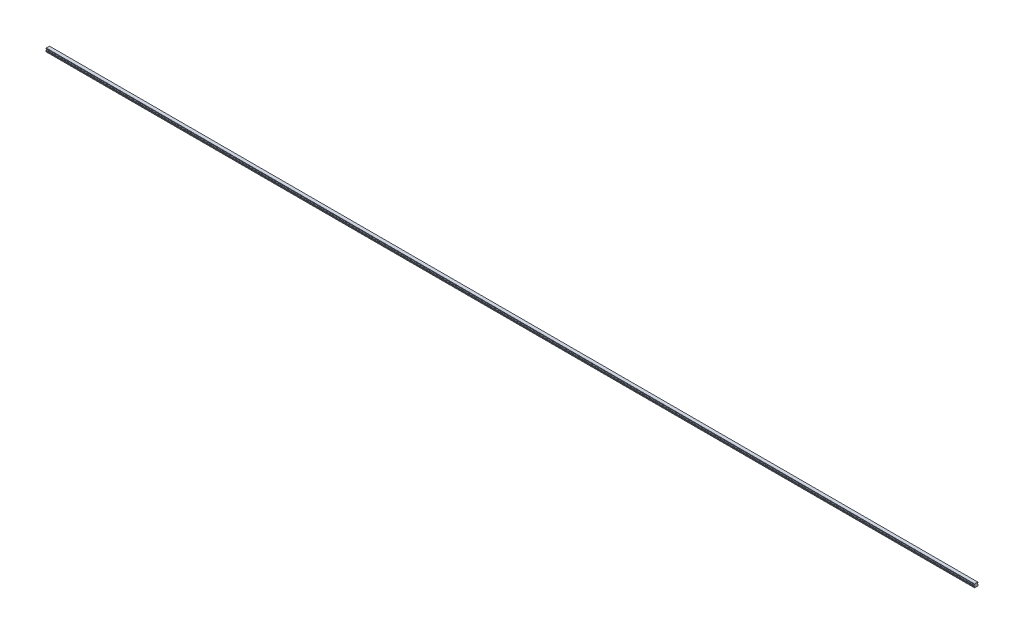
from build123d import *

# Parameters (mm, degrees)
BOSS_EXTRUDE1_DEPTH        = 3720
SKETCH3_R                  = 2.5
SKETCH3_R_2                = 2.1
CUT_EXTRUDE3_DEPTH         = 7
SKETCH3_2_R                = 2.1
CUT_EXTRUDE4_DEPTH         = 9.5
CHAMFER1_SIZE              = 0.4
LPATTERN2_COUNT            = 62
LPATTERN2_PITCH            = 60
CHAMFER1_OF_LPATTERN2_SIZE = 0.4


with BuildPart() as part:
    # Sketch1 → Boss-Extrude1 (new body)
    with BuildSketch(Plane(origin=(0, 0, 0), x_dir=(0, 0, -1), z_dir=(1, 0, 0))):
        with BuildLine():
            Line((6.59, 14), (-6.59, 14))
            Line((-6.59, 14), (-6.59, 13.15))
            Line((-6.59, 13.15), (-6.96, 12.356532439))
            Line((-6.96, 12.356532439), (-6.96, 11.435174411))
            ThreePointArc((-6.96, 11.435174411), (-5.25, 9.5), (-6.96, 7.564825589))
            Line((-6.96, 7.564825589), (-6.96, 6.643467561))
            Line((-6.96, 6.643467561), (-6.59, 5.85))
            Line((-6.59, 5.85), (-7.032116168, 4.2))
            Line((-7.032116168, 4.2), (-7.5, 3.929867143))
            Line((-7.5, 3.929867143), (-7.5, 1.4))
            Line((-7.5, 1.4), (-6.1, 0))
            Line((-6.1, 0), (-3.65, 0))
            Line((-3.65, 0), (-3.25, 0.4))
            Line((-3.25, 0.4), (3.25, 0.4))
            Line((3.25, 0.4), (3.65, 0))
            Line((3.65, 0), (6.1, 0))
            Line((6.1, 0), (7.5, 1.4))
            Line((7.5, 1.4), (7.5, 3.929867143))
            Line((7.5, 3.929867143), (7.032116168, 4.2))
            Line((7.032116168, 4.2), (6.59, 5.85))
            Line((6.59, 5.85), (6.96, 6.643467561))
            Line((6.96, 6.643467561), (6.96, 7.564825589))
            ThreePointArc((6.96, 7.564825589), (5.25, 9.5), (6.96, 11.435174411))
            Line((6.96, 11.435174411), (6.96, 12.356532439))
            Line((6.96, 12.356532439), (6.59, 13.15))
            Line((6.59, 13.15), (6.59, 14))
        make_face()
    extrude(amount=BOSS_EXTRUDE1_DEPTH)

    # Sketch3 → Cut-Extrude3 (cut)
    with BuildSketch(Plane.XZ):
        with Locations(Location((30, 0, 0), (0, 0, 270))):
            Circle(SKETCH3_R)
        with Locations(Location((30, 0, 0), (0, 0, 270))):
            Circle(SKETCH3_R_2, mode=Mode.SUBTRACT)
    cut_extrude3 = extrude(amount=-CUT_EXTRUDE3_DEPTH, mode=Mode.SUBTRACT)

    # Sketch3_2 → Cut-Extrude4 (cut)
    with BuildSketch(Plane.XZ):
        with Locations(Location((30, 0, 0), (0, 0, 270))):
            Circle(SKETCH3_2_R)
    cut_extrude4 = extrude(amount=-CUT_EXTRUDE4_DEPTH, mode=Mode.SUBTRACT)

    # Cut-Extrude5 cone 1 section (on through the dimple's axis) → Cut-Extrude5 (revolve, cut)
    with BuildSketch(Plane(origin=(30, 9.5, 0), x_dir=(0, 0, -1), z_dir=(1, 0, 0))):
        Polygon((0, 0), (2.1, 0), (0, 1.212435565), align=None)
    revolve(axis=Axis((30, 9.5, 0), (0, 1, 0)), mode=Mode.SUBTRACT)

    # Chamfer1
    chamfer1_edges = [part.edges().sort_by_distance(p)[0] for p in [
        (30, 0.4, 2.5),
    ]]
    chamfer(chamfer1_edges, length=CHAMFER1_SIZE)

    # LPattern2: Cut-Extrude3, Cut-Extrude4 ×62
    with Locations(*[(i * LPATTERN2_PITCH, 0, 0) for i in range(1, LPATTERN2_COUNT)]):
        add(cut_extrude3, mode=Mode.SUBTRACT)
        add(cut_extrude4, mode=Mode.SUBTRACT)

    # Chamfer1 of LPattern2
    chamfer1_of_lpattern2_edges = [part.edges().sort_by_distance(p)[0] for p in [
        (90, 0.4, 2.5),
        (150, 0.4, 2.5),
        (210, 0.4, 2.5),
        (270, 0.4, 2.5),
        (330, 0.4, 2.5),
        (390, 0.4, 2.5),
        (450, 0.4, 2.5),
        (510, 0.4, 2.5),
        (570, 0.4, 2.5),
        (630, 0.4, 2.5),
        (690, 0.4, 2.5),
        (750, 0.4, 2.5),
        (810, 0.4, 2.5),
        (870, 0.4, 2.5),
        (930, 0.4, 2.5),
        (990, 0.4, 2.5),
        (1050, 0.4, 2.5),
        (1110, 0.4, 2.5),
        (1170, 0.4, 2.5),
        (1230, 0.4, 2.5),
        (1290, 0.4, 2.5),
        (1350, 0.4, 2.5),
        (1410, 0.4, 2.5),
        (1470, 0.4, 2.5),
        (1530, 0.4, 2.5),
        (1590, 0.4, 2.5),
        (1650, 0.4, 2.5),
        (1710, 0.4, 2.5),
        (1770, 0.4, 2.5),
        (1830, 0.4, 2.5),
        (1890, 0.4, 2.5),
        (1950, 0.4, 2.5),
        (2010, 0.4, 2.5),
        (2070, 0.4, 2.5),
        (2130, 0.4, 2.5),
        (2190, 0.4, 2.5),
        (2250, 0.4, 2.5),
        (2310, 0.4, 2.5),
        (2370, 0.4, 2.5),
        (2430, 0.4, 2.5),
        (2490, 0.4, 2.5),
        (2550, 0.4, 2.5),
        (2610, 0.4, 2.5),
        (2670, 0.4, 2.5),
        (2730, 0.4, 2.5),
        (2790, 0.4, 2.5),
        (2850, 0.4, 2.5),
        (2910, 0.4, 2.5),
        (2970, 0.4, 2.5),
        (3030, 0.4, 2.5),
        (3090, 0.4, 2.5),
        (3150, 0.4, 2.5),
        (3210, 0.4, 2.5),
        (3270, 0.4, 2.5),
        (3330, 0.4, 2.5),
        (3390, 0.4, 2.5),
        (3450, 0.4, 2.5),
        (3510, 0.4, 2.5),
        (3570, 0.4, 2.5),
        (3630, 0.4, 2.5),
        (3690, 0.4, 2.5),
    ]]
    chamfer(chamfer1_of_lpattern2_edges, length=CHAMFER1_OF_LPATTERN2_SIZE)


solid = part.part
